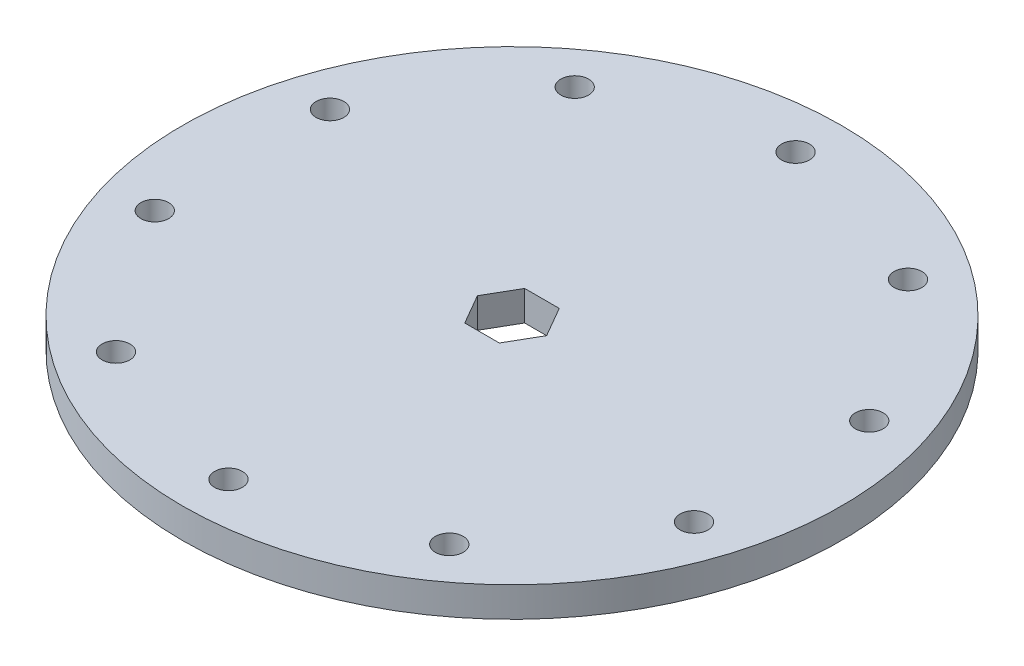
from build123d import *

# Parameters (mm, degrees)
SKETCH1_R             = 34.925
BOSS_EXTRUDE1_DEPTH   = 3.175
F_4_CLEARANCE_HOLE1_D = 2.9464


with BuildPart() as part:
    # Sketch1 → Boss-Extrude1 (new body)
    with BuildSketch(Plane(origin=(0, 0, 0), x_dir=(1, 0, 0), z_dir=(0, 1, 0))):
        with Locations(Location((0, 0, 0), (0, 0, 270))):
            Circle(SKETCH1_R)
        Polygon((1.833087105, 3.175), (-1.833087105, 3.175), (-3.666174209, 0), (-1.833087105, -3.175), (1.833087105, -3.175), (3.666174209, 0), align=None, mode=Mode.SUBTRACT)
    extrude(amount=BOSS_EXTRUDE1_DEPTH)

    # 4 Clearance Hole1 (through all)
    with Locations(Plane(origin=(0, 3.175, 0), x_dir=(1, 0, 0), z_dir=(0, 1, 0))):
        with Locations((0, 30.045533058), (-17.660321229, 24.307346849), (-28.575, 9.28458032), (-28.575, -9.28458032), (-17.660321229, -24.307346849), (0, -30.045533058), (17.660321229, -24.307346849), (28.575, -9.28458032), (28.575, 9.28458032), (17.660321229, 24.307346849)):
            Hole(F_4_CLEARANCE_HOLE1_D / 2)


solid = part.part
